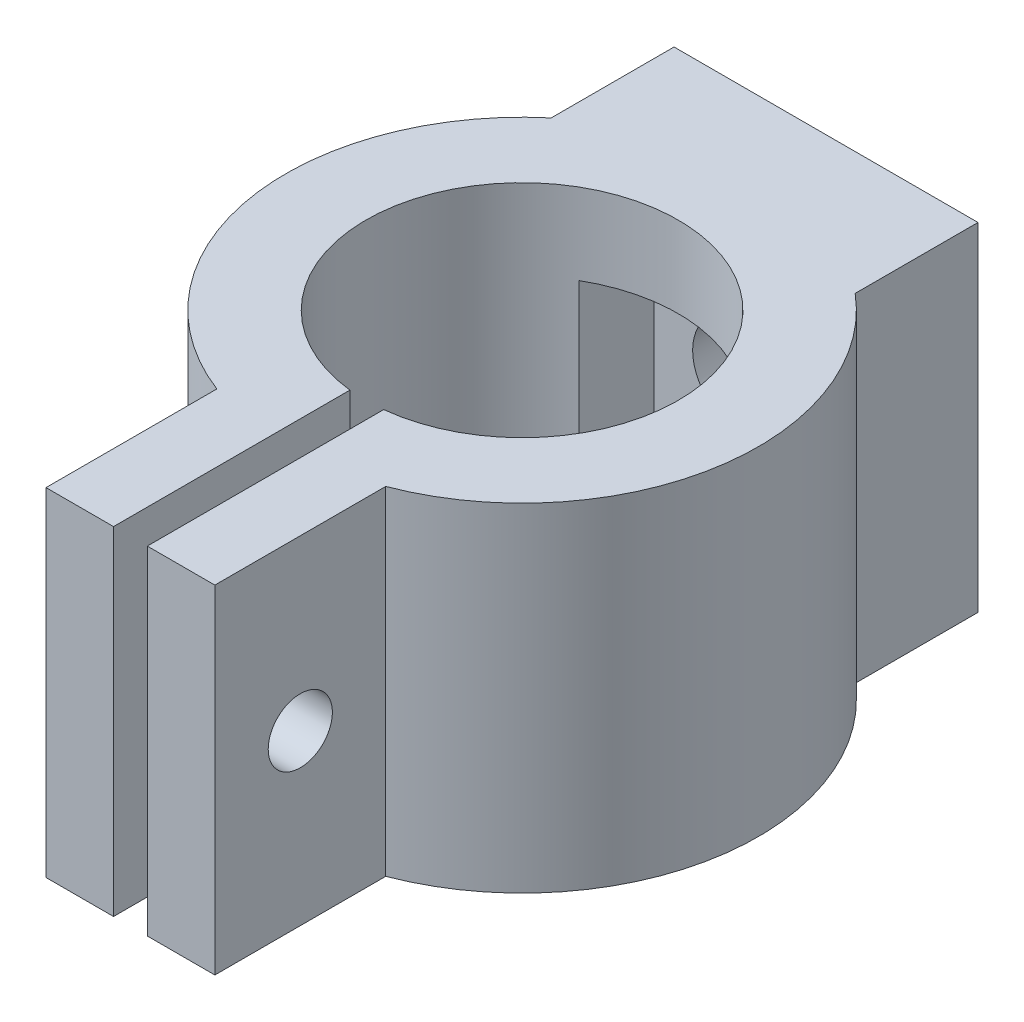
ISO-10303-21;
HEADER;
FILE_DESCRIPTION(('STEP AP214'),'2;1');
FILE_NAME('part.step','',(''),(''),'','','');
FILE_SCHEMA(('AUTOMOTIVE_DESIGN { 1 0 10303 214 1 1 1 1 }'));
ENDSEC;
DATA;
#1=APPLICATION_CONTEXT('core data for automotive mechanical design processes');
#2=APPLICATION_PROTOCOL_DEFINITION('international standard','automotive_design',2000,#1);
#3=PRODUCT_CONTEXT('',#1,'mechanical');
#4=PRODUCT('Part','Part','',(#3));
#5=PRODUCT_RELATED_PRODUCT_CATEGORY('part','',(#4));
#6=PRODUCT_DEFINITION_FORMATION('','',#4);
#7=PRODUCT_DEFINITION_CONTEXT('part definition',#1,'design');
#8=PRODUCT_DEFINITION('design','',#6,#7);
#9=PRODUCT_DEFINITION_SHAPE('','',#8);
#10=(LENGTH_UNIT() NAMED_UNIT(*) SI_UNIT(.MILLI.,.METRE.));
#11=(NAMED_UNIT(*) PLANE_ANGLE_UNIT() SI_UNIT($,.RADIAN.));
#12=(NAMED_UNIT(*) SI_UNIT($,.STERADIAN.) SOLID_ANGLE_UNIT());
#13=UNCERTAINTY_MEASURE_WITH_UNIT(LENGTH_MEASURE(1.E-05),#10,'distance_accuracy_value','');
#14=(GEOMETRIC_REPRESENTATION_CONTEXT(3) GLOBAL_UNCERTAINTY_ASSIGNED_CONTEXT((#13)) GLOBAL_UNIT_ASSIGNED_CONTEXT((#10,
#11,#12)) REPRESENTATION_CONTEXT('',''));
#15=CARTESIAN_POINT('',(0.,0.,0.));
#16=DIRECTION('',(0.,0.,1.));
#17=DIRECTION('',(1.,0.,0.));
#18=AXIS2_PLACEMENT_3D('',#15,#16,#17);
#19=CARTESIAN_POINT('',(0.,10.,9.));
#20=DIRECTION('',(0.,-1.,0.));
#21=DIRECTION('',(0.,0.,-1.));
#22=AXIS2_PLACEMENT_3D('',#19,#20,#21);
#23=CYLINDRICAL_SURFACE('',#22,4.625);
#24=CARTESIAN_POINT('',(0.,0.,9.));
#25=DIRECTION('',(0.,1.,0.));
#26=DIRECTION('',(0.,0.,1.));
#27=AXIS2_PLACEMENT_3D('',#24,#25,#26);
#28=CIRCLE('',#27,4.625);
#29=CARTESIAN_POINT('',(0.5,0.,13.5978935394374));
#30=VERTEX_POINT('',#29);
#31=CARTESIAN_POINT('',(-0.500000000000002,0.,13.5978935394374));
#32=VERTEX_POINT('',#31);
#33=EDGE_CURVE('E192',#30,#32,#28,.T.);
#34=ORIENTED_EDGE('',*,*,#33,.F.);
#35=DIRECTION('',(0.,-1.,0.));
#36=VECTOR('',#35,1.);
#37=CARTESIAN_POINT('',(0.5,10.,13.5978935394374));
#38=LINE('',#37,#36);
#39=CARTESIAN_POINT('',(0.5,10.,13.5978935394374));
#40=VERTEX_POINT('',#39);
#41=EDGE_CURVE('E56',#40,#30,#38,.T.);
#42=ORIENTED_EDGE('',*,*,#41,.F.);
#43=CARTESIAN_POINT('',(0.,10.,9.));
#44=DIRECTION('',(0.,1.,0.));
#45=DIRECTION('',(0.,0.,1.));
#46=AXIS2_PLACEMENT_3D('',#43,#44,#45);
#47=CIRCLE('',#46,4.625);
#48=CARTESIAN_POINT('',(-0.500000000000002,10.,13.5978935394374));
#49=VERTEX_POINT('',#48);
#50=EDGE_CURVE('E160',#40,#49,#47,.T.);
#51=ORIENTED_EDGE('',*,*,#50,.T.);
#52=DIRECTION('',(0.,-1.,0.));
#53=VECTOR('',#52,1.);
#54=CARTESIAN_POINT('',(-0.500000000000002,10.,13.5978935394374));
#55=LINE('',#54,#53);
#56=EDGE_CURVE('E157',#49,#32,#55,.T.);
#57=ORIENTED_EDGE('',*,*,#56,.T.);
#58=EDGE_LOOP('',(#34,#42,#51,#57));
#59=FACE_BOUND('',#58,.T.);
#60=CARTESIAN_POINT('',(0.,7.6,9.));
#61=DIRECTION('',(0.,-1.,0.));
#62=DIRECTION('',(0.,0.,-1.));
#63=AXIS2_PLACEMENT_3D('',#60,#61,#62);
#64=CIRCLE('',#63,4.625);
#65=CARTESIAN_POINT('',(-2.32177195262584,7.6,5.));
#66=VERTEX_POINT('',#65);
#67=CARTESIAN_POINT('',(2.32177195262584,7.6,5.));
#68=VERTEX_POINT('',#67);
#69=EDGE_CURVE('E40',#66,#68,#64,.T.);
#70=ORIENTED_EDGE('',*,*,#69,.T.);
#71=DIRECTION('',(0.,-1.,0.));
#72=VECTOR('',#71,1.);
#73=CARTESIAN_POINT('',(2.32177195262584,10.,5.));
#74=LINE('',#73,#72);
#75=CARTESIAN_POINT('',(2.32177195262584,2.4,5.));
#76=VERTEX_POINT('',#75);
#77=EDGE_CURVE('E11',#68,#76,#74,.T.);
#78=ORIENTED_EDGE('',*,*,#77,.T.);
#79=CARTESIAN_POINT('',(0.,2.4,9.));
#80=DIRECTION('',(0.,1.,0.));
#81=DIRECTION('',(0.,0.,1.));
#82=AXIS2_PLACEMENT_3D('',#79,#80,#81);
#83=CIRCLE('',#82,4.625);
#84=CARTESIAN_POINT('',(-2.32177195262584,2.4,5.));
#85=VERTEX_POINT('',#84);
#86=EDGE_CURVE('E229',#76,#85,#83,.T.);
#87=ORIENTED_EDGE('',*,*,#86,.T.);
#88=DIRECTION('',(0.,-1.,0.));
#89=VECTOR('',#88,1.);
#90=CARTESIAN_POINT('',(-2.32177195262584,10.,5.));
#91=LINE('',#90,#89);
#92=EDGE_CURVE('E216',#85,#66,#91,.F.);
#93=ORIENTED_EDGE('',*,*,#92,.T.);
#94=EDGE_LOOP('',(#70,#78,#87,#93));
#95=FACE_BOUND('',#94,.T.);
#96=ADVANCED_FACE('F32',(#59,#95),#23,.F.);
#97=CARTESIAN_POINT('',(0.5,10.,13.5978935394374));
#98=DIRECTION('',(1.,0.,0.));
#99=DIRECTION('',(0.,0.,-1.));
#100=AXIS2_PLACEMENT_3D('',#97,#98,#99);
#101=PLANE('',#100);
#102=CARTESIAN_POINT('',(0.5,5.,18.0681209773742));
#103=DIRECTION('',(1.,0.,0.));
#104=DIRECTION('',(0.,0.,-1.));
#105=AXIS2_PLACEMENT_3D('',#102,#103,#104);
#106=CIRCLE('',#105,0.950000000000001);
#107=CARTESIAN_POINT('',(0.5,5.,17.1181209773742));
#108=VERTEX_POINT('',#107);
#109=EDGE_CURVE('E220',#108,#108,#106,.T.);
#110=ORIENTED_EDGE('',*,*,#109,.T.);
#111=EDGE_LOOP('',(#110));
#112=FACE_BOUND('',#111,.T.);
#113=DIRECTION('',(0.,0.,1.));
#114=VECTOR('',#113,1.);
#115=CARTESIAN_POINT('',(0.5,0.,13.5978935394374));
#116=LINE('',#115,#114);
#117=CARTESIAN_POINT('',(0.500000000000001,0.,20.5978935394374));
#118=VERTEX_POINT('',#117);
#119=EDGE_CURVE('E165',#30,#118,#116,.T.);
#120=ORIENTED_EDGE('',*,*,#119,.T.);
#121=DIRECTION('',(0.,-1.,0.));
#122=VECTOR('',#121,1.);
#123=CARTESIAN_POINT('',(0.500000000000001,10.,20.5978935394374));
#124=LINE('',#123,#122);
#125=CARTESIAN_POINT('',(0.500000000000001,10.,20.5978935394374));
#126=VERTEX_POINT('',#125);
#127=EDGE_CURVE('E214',#126,#118,#124,.T.);
#128=ORIENTED_EDGE('',*,*,#127,.F.);
#129=DIRECTION('',(0.,0.,1.));
#130=VECTOR('',#129,1.);
#131=CARTESIAN_POINT('',(0.5,10.,13.5978935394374));
#132=LINE('',#131,#130);
#133=EDGE_CURVE('E107',#40,#126,#132,.T.);
#134=ORIENTED_EDGE('',*,*,#133,.F.);
#135=ORIENTED_EDGE('',*,*,#41,.T.);
#136=EDGE_LOOP('',(#120,#128,#134,#135));
#137=FACE_BOUND('',#136,.T.);
#138=ADVANCED_FACE('F34',(#112,#137),#101,.F.);
#139=CARTESIAN_POINT('',(2.5,10.,20.5978935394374));
#140=DIRECTION('',(0.,0.,1.));
#141=DIRECTION('',(1.,0.,0.));
#142=AXIS2_PLACEMENT_3D('',#139,#140,#141);
#143=PLANE('',#142);
#144=DIRECTION('',(-1.,0.,0.));
#145=VECTOR('',#144,1.);
#146=CARTESIAN_POINT('',(2.5,0.,20.5978935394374));
#147=LINE('',#146,#145);
#148=CARTESIAN_POINT('',(2.5,0.,20.5978935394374));
#149=VERTEX_POINT('',#148);
#150=EDGE_CURVE('E167',#149,#118,#147,.T.);
#151=ORIENTED_EDGE('',*,*,#150,.F.);
#152=DIRECTION('',(0.,-1.,0.));
#153=VECTOR('',#152,1.);
#154=CARTESIAN_POINT('',(2.5,10.,20.5978935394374));
#155=LINE('',#154,#153);
#156=CARTESIAN_POINT('',(2.5,10.,20.5978935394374));
#157=VERTEX_POINT('',#156);
#158=EDGE_CURVE('E212',#157,#149,#155,.T.);
#159=ORIENTED_EDGE('',*,*,#158,.F.);
#160=DIRECTION('',(-1.,0.,0.));
#161=VECTOR('',#160,1.);
#162=CARTESIAN_POINT('',(2.5,10.,20.5978935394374));
#163=LINE('',#162,#161);
#164=EDGE_CURVE('E282',#157,#126,#163,.T.);
#165=ORIENTED_EDGE('',*,*,#164,.T.);
#166=ORIENTED_EDGE('',*,*,#127,.T.);
#167=EDGE_LOOP('',(#151,#159,#165,#166));
#168=FACE_BOUND('',#167,.T.);
#169=ADVANCED_FACE('F317',(#168),#143,.T.);
#170=CARTESIAN_POINT('',(2.5,10.,15.538348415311));
#171=DIRECTION('',(1.,0.,0.));
#172=DIRECTION('',(0.,0.,-1.));
#173=AXIS2_PLACEMENT_3D('',#170,#171,#172);
#174=PLANE('',#173);
#175=CARTESIAN_POINT('',(2.5,5.,18.0681209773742));
#176=DIRECTION('',(-1.,0.,0.));
#177=DIRECTION('',(0.,0.,1.));
#178=AXIS2_PLACEMENT_3D('',#175,#176,#177);
#179=CIRCLE('',#178,0.950000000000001);
#180=CARTESIAN_POINT('',(2.5,5.,19.0181209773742));
#181=VERTEX_POINT('',#180);
#182=EDGE_CURVE('E221',#181,#181,#179,.T.);
#183=ORIENTED_EDGE('',*,*,#182,.T.);
#184=EDGE_LOOP('',(#183));
#185=FACE_BOUND('',#184,.T.);
#186=DIRECTION('',(0.,0.,1.));
#187=VECTOR('',#186,1.);
#188=CARTESIAN_POINT('',(2.5,0.,15.538348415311));
#189=LINE('',#188,#187);
#190=CARTESIAN_POINT('',(2.5,0.,15.538348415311));
#191=VERTEX_POINT('',#190);
#192=EDGE_CURVE('E171',#191,#149,#189,.T.);
#193=ORIENTED_EDGE('',*,*,#192,.F.);
#194=DIRECTION('',(0.,-1.,0.));
#195=VECTOR('',#194,1.);
#196=CARTESIAN_POINT('',(2.5,10.,15.538348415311));
#197=LINE('',#196,#195);
#198=CARTESIAN_POINT('',(2.5,10.,15.538348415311));
#199=VERTEX_POINT('',#198);
#200=EDGE_CURVE('E210',#199,#191,#197,.T.);
#201=ORIENTED_EDGE('',*,*,#200,.F.);
#202=DIRECTION('',(0.,0.,1.));
#203=VECTOR('',#202,1.);
#204=CARTESIAN_POINT('',(2.5,10.,15.538348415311));
#205=LINE('',#204,#203);
#206=EDGE_CURVE('E285',#199,#157,#205,.T.);
#207=ORIENTED_EDGE('',*,*,#206,.T.);
#208=ORIENTED_EDGE('',*,*,#158,.T.);
#209=EDGE_LOOP('',(#193,#201,#207,#208));
#210=FACE_BOUND('',#209,.T.);
#211=ADVANCED_FACE('F347',(#185,#210),#174,.T.);
#212=CARTESIAN_POINT('',(0.,10.,9.));
#213=DIRECTION('',(0.,-1.,0.));
#214=DIRECTION('',(0.,0.,-1.));
#215=AXIS2_PLACEMENT_3D('',#212,#213,#214);
#216=CYLINDRICAL_SURFACE('',#215,7.);
#217=CARTESIAN_POINT('',(0.,0.,9.));
#218=DIRECTION('',(0.,1.,0.));
#219=DIRECTION('',(0.,0.,1.));
#220=AXIS2_PLACEMENT_3D('',#217,#218,#219);
#221=CIRCLE('',#220,7.);
#222=CARTESIAN_POINT('',(4.5,0.,3.63809735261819));
#223=VERTEX_POINT('',#222);
#224=EDGE_CURVE('E174',#191,#223,#221,.T.);
#225=ORIENTED_EDGE('',*,*,#224,.T.);
#226=DIRECTION('',(0.,-1.,0.));
#227=VECTOR('',#226,1.);
#228=CARTESIAN_POINT('',(4.5,10.,3.63809735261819));
#229=LINE('',#228,#227);
#230=CARTESIAN_POINT('',(4.5,10.,3.63809735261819));
#231=VERTEX_POINT('',#230);
#232=EDGE_CURVE('E208',#231,#223,#229,.T.);
#233=ORIENTED_EDGE('',*,*,#232,.F.);
#234=CARTESIAN_POINT('',(0.,10.,9.));
#235=DIRECTION('',(0.,1.,0.));
#236=DIRECTION('',(0.,0.,1.));
#237=AXIS2_PLACEMENT_3D('',#234,#235,#236);
#238=CIRCLE('',#237,7.);
#239=EDGE_CURVE('E288',#199,#231,#238,.T.);
#240=ORIENTED_EDGE('',*,*,#239,.F.);
#241=ORIENTED_EDGE('',*,*,#200,.T.);
#242=EDGE_LOOP('',(#225,#233,#240,#241));
#243=FACE_BOUND('',#242,.T.);
#244=ADVANCED_FACE('F343',(#243),#216,.T.);
#245=CARTESIAN_POINT('',(4.5,10.,0.));
#246=DIRECTION('',(1.,0.,0.));
#247=DIRECTION('',(0.,0.,-1.));
#248=AXIS2_PLACEMENT_3D('',#245,#246,#247);
#249=PLANE('',#248);
#250=DIRECTION('',(0.,0.,1.));
#251=VECTOR('',#250,1.);
#252=CARTESIAN_POINT('',(4.5,0.,0.));
#253=LINE('',#252,#251);
#254=CARTESIAN_POINT('',(4.5,0.,0.));
#255=VERTEX_POINT('',#254);
#256=EDGE_CURVE('E177',#255,#223,#253,.T.);
#257=ORIENTED_EDGE('',*,*,#256,.F.);
#258=DIRECTION('',(0.,-1.,0.));
#259=VECTOR('',#258,1.);
#260=CARTESIAN_POINT('',(4.5,10.,0.));
#261=LINE('',#260,#259);
#262=CARTESIAN_POINT('',(4.5,10.,0.));
#263=VERTEX_POINT('',#262);
#264=EDGE_CURVE('E206',#263,#255,#261,.T.);
#265=ORIENTED_EDGE('',*,*,#264,.F.);
#266=DIRECTION('',(0.,0.,1.));
#267=VECTOR('',#266,1.);
#268=CARTESIAN_POINT('',(4.5,10.,0.));
#269=LINE('',#268,#267);
#270=EDGE_CURVE('E290',#263,#231,#269,.T.);
#271=ORIENTED_EDGE('',*,*,#270,.T.);
#272=ORIENTED_EDGE('',*,*,#232,.T.);
#273=EDGE_LOOP('',(#257,#265,#271,#272));
#274=FACE_BOUND('',#273,.T.);
#275=ADVANCED_FACE('F339',(#274),#249,.T.);
#276=CARTESIAN_POINT('',(-4.5,10.,0.));
#277=DIRECTION('',(0.,0.,-1.));
#278=DIRECTION('',(-1.,0.,0.));
#279=AXIS2_PLACEMENT_3D('',#276,#277,#278);
#280=PLANE('',#279);
#281=CARTESIAN_POINT('',(0.,5.,0.));
#282=DIRECTION('',(0.,0.,-1.));
#283=DIRECTION('',(-1.,0.,0.));
#284=AXIS2_PLACEMENT_3D('',#281,#282,#283);
#285=CIRCLE('',#284,1.45);
#286=CARTESIAN_POINT('',(-1.45,5.,0.));
#287=VERTEX_POINT('',#286);
#288=EDGE_CURVE('E168',#287,#287,#285,.T.);
#289=ORIENTED_EDGE('',*,*,#288,.F.);
#290=EDGE_LOOP('',(#289));
#291=FACE_BOUND('',#290,.T.);
#292=DIRECTION('',(1.,0.,0.));
#293=VECTOR('',#292,1.);
#294=CARTESIAN_POINT('',(-4.5,0.,0.));
#295=LINE('',#294,#293);
#296=CARTESIAN_POINT('',(-4.5,0.,0.));
#297=VERTEX_POINT('',#296);
#298=EDGE_CURVE('E180',#297,#255,#295,.T.);
#299=ORIENTED_EDGE('',*,*,#298,.F.);
#300=DIRECTION('',(0.,-1.,0.));
#301=VECTOR('',#300,1.);
#302=CARTESIAN_POINT('',(-4.5,10.,0.));
#303=LINE('',#302,#301);
#304=CARTESIAN_POINT('',(-4.5,10.,0.));
#305=VERTEX_POINT('',#304);
#306=EDGE_CURVE('E204',#305,#297,#303,.T.);
#307=ORIENTED_EDGE('',*,*,#306,.F.);
#308=DIRECTION('',(1.,0.,0.));
#309=VECTOR('',#308,1.);
#310=CARTESIAN_POINT('',(-4.5,10.,0.));
#311=LINE('',#310,#309);
#312=EDGE_CURVE('E293',#305,#263,#311,.T.);
#313=ORIENTED_EDGE('',*,*,#312,.T.);
#314=ORIENTED_EDGE('',*,*,#264,.T.);
#315=EDGE_LOOP('',(#299,#307,#313,#314));
#316=FACE_BOUND('',#315,.T.);
#317=ADVANCED_FACE('F335',(#291,#316),#280,.T.);
#318=CARTESIAN_POINT('',(-4.5,10.,0.));
#319=DIRECTION('',(1.,0.,0.));
#320=DIRECTION('',(0.,0.,-1.));
#321=AXIS2_PLACEMENT_3D('',#318,#319,#320);
#322=PLANE('',#321);
#323=DIRECTION('',(0.,0.,1.));
#324=VECTOR('',#323,1.);
#325=CARTESIAN_POINT('',(-4.5,0.,0.));
#326=LINE('',#325,#324);
#327=CARTESIAN_POINT('',(-4.5,0.,3.63809735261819));
#328=VERTEX_POINT('',#327);
#329=EDGE_CURVE('E183',#297,#328,#326,.T.);
#330=ORIENTED_EDGE('',*,*,#329,.T.);
#331=DIRECTION('',(0.,-1.,0.));
#332=VECTOR('',#331,1.);
#333=CARTESIAN_POINT('',(-4.5,10.,3.63809735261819));
#334=LINE('',#333,#332);
#335=CARTESIAN_POINT('',(-4.5,10.,3.63809735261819));
#336=VERTEX_POINT('',#335);
#337=EDGE_CURVE('E201',#336,#328,#334,.T.);
#338=ORIENTED_EDGE('',*,*,#337,.F.);
#339=DIRECTION('',(0.,0.,1.));
#340=VECTOR('',#339,1.);
#341=CARTESIAN_POINT('',(-4.5,10.,0.));
#342=LINE('',#341,#340);
#343=EDGE_CURVE('E296',#305,#336,#342,.T.);
#344=ORIENTED_EDGE('',*,*,#343,.F.);
#345=ORIENTED_EDGE('',*,*,#306,.T.);
#346=EDGE_LOOP('',(#330,#338,#344,#345));
#347=FACE_BOUND('',#346,.T.);
#348=ADVANCED_FACE('F332',(#347),#322,.F.);
#349=CARTESIAN_POINT('',(0.,10.,9.));
#350=DIRECTION('',(0.,-1.,0.));
#351=DIRECTION('',(0.,0.,-1.));
#352=AXIS2_PLACEMENT_3D('',#349,#350,#351);
#353=CYLINDRICAL_SURFACE('',#352,7.);
#354=CARTESIAN_POINT('',(0.,0.,9.));
#355=DIRECTION('',(0.,1.,0.));
#356=DIRECTION('',(0.,0.,1.));
#357=AXIS2_PLACEMENT_3D('',#354,#355,#356);
#358=CIRCLE('',#357,7.);
#359=CARTESIAN_POINT('',(-2.5,0.,15.538348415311));
#360=VERTEX_POINT('',#359);
#361=EDGE_CURVE('E185',#328,#360,#358,.T.);
#362=ORIENTED_EDGE('',*,*,#361,.T.);
#363=DIRECTION('',(0.,-1.,0.));
#364=VECTOR('',#363,1.);
#365=CARTESIAN_POINT('',(-2.5,10.,15.538348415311));
#366=LINE('',#365,#364);
#367=CARTESIAN_POINT('',(-2.5,10.,15.538348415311));
#368=VERTEX_POINT('',#367);
#369=EDGE_CURVE('E198',#368,#360,#366,.T.);
#370=ORIENTED_EDGE('',*,*,#369,.F.);
#371=CARTESIAN_POINT('',(0.,10.,9.));
#372=DIRECTION('',(0.,1.,0.));
#373=DIRECTION('',(0.,0.,1.));
#374=AXIS2_PLACEMENT_3D('',#371,#372,#373);
#375=CIRCLE('',#374,7.);
#376=EDGE_CURVE('E298',#336,#368,#375,.T.);
#377=ORIENTED_EDGE('',*,*,#376,.F.);
#378=ORIENTED_EDGE('',*,*,#337,.T.);
#379=EDGE_LOOP('',(#362,#370,#377,#378));
#380=FACE_BOUND('',#379,.T.);
#381=ADVANCED_FACE('F305',(#380),#353,.T.);
#382=CARTESIAN_POINT('',(-2.5,10.,15.538348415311));
#383=DIRECTION('',(1.,0.,0.));
#384=DIRECTION('',(0.,0.,-1.));
#385=AXIS2_PLACEMENT_3D('',#382,#383,#384);
#386=PLANE('',#385);
#387=CARTESIAN_POINT('',(-2.5,5.,18.0681209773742));
#388=DIRECTION('',(-1.,0.,0.));
#389=DIRECTION('',(0.,0.,1.));
#390=AXIS2_PLACEMENT_3D('',#387,#388,#389);
#391=CIRCLE('',#390,0.950000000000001);
#392=CARTESIAN_POINT('',(-2.5,5.,19.0181209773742));
#393=VERTEX_POINT('',#392);
#394=EDGE_CURVE('E225',#393,#393,#391,.T.);
#395=ORIENTED_EDGE('',*,*,#394,.F.);
#396=EDGE_LOOP('',(#395));
#397=FACE_BOUND('',#396,.T.);
#398=DIRECTION('',(0.,0.,1.));
#399=VECTOR('',#398,1.);
#400=CARTESIAN_POINT('',(-2.5,0.,15.538348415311));
#401=LINE('',#400,#399);
#402=CARTESIAN_POINT('',(-2.5,0.,20.5978935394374));
#403=VERTEX_POINT('',#402);
#404=EDGE_CURVE('E187',#360,#403,#401,.T.);
#405=ORIENTED_EDGE('',*,*,#404,.T.);
#406=DIRECTION('',(0.,-1.,0.));
#407=VECTOR('',#406,1.);
#408=CARTESIAN_POINT('',(-2.5,10.,20.5978935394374));
#409=LINE('',#408,#407);
#410=CARTESIAN_POINT('',(-2.5,10.,20.5978935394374));
#411=VERTEX_POINT('',#410);
#412=EDGE_CURVE('E156',#411,#403,#409,.T.);
#413=ORIENTED_EDGE('',*,*,#412,.F.);
#414=DIRECTION('',(0.,0.,1.));
#415=VECTOR('',#414,1.);
#416=CARTESIAN_POINT('',(-2.5,10.,15.538348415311));
#417=LINE('',#416,#415);
#418=EDGE_CURVE('E143',#368,#411,#417,.T.);
#419=ORIENTED_EDGE('',*,*,#418,.F.);
#420=ORIENTED_EDGE('',*,*,#369,.T.);
#421=EDGE_LOOP('',(#405,#413,#419,#420));
#422=FACE_BOUND('',#421,.T.);
#423=ADVANCED_FACE('F309',(#397,#422),#386,.F.);
#424=CARTESIAN_POINT('',(-2.5,10.,20.5978935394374));
#425=DIRECTION('',(0.,0.,-1.));
#426=DIRECTION('',(-1.,0.,0.));
#427=AXIS2_PLACEMENT_3D('',#424,#425,#426);
#428=PLANE('',#427);
#429=DIRECTION('',(1.,0.,0.));
#430=VECTOR('',#429,1.);
#431=CARTESIAN_POINT('',(-2.5,0.,20.5978935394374));
#432=LINE('',#431,#430);
#433=CARTESIAN_POINT('',(-0.500000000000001,0.,20.5978935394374));
#434=VERTEX_POINT('',#433);
#435=EDGE_CURVE('E152',#403,#434,#432,.T.);
#436=ORIENTED_EDGE('',*,*,#435,.T.);
#437=DIRECTION('',(0.,-1.,0.));
#438=VECTOR('',#437,1.);
#439=CARTESIAN_POINT('',(-0.500000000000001,10.,20.5978935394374));
#440=LINE('',#439,#438);
#441=CARTESIAN_POINT('',(-0.500000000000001,10.,20.5978935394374));
#442=VERTEX_POINT('',#441);
#443=EDGE_CURVE('E149',#442,#434,#440,.T.);
#444=ORIENTED_EDGE('',*,*,#443,.F.);
#445=DIRECTION('',(1.,0.,0.));
#446=VECTOR('',#445,1.);
#447=CARTESIAN_POINT('',(-2.5,10.,20.5978935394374));
#448=LINE('',#447,#446);
#449=EDGE_CURVE('E137',#411,#442,#448,.T.);
#450=ORIENTED_EDGE('',*,*,#449,.F.);
#451=ORIENTED_EDGE('',*,*,#412,.T.);
#452=EDGE_LOOP('',(#436,#444,#450,#451));
#453=FACE_BOUND('',#452,.T.);
#454=ADVANCED_FACE('F150',(#453),#428,.F.);
#455=CARTESIAN_POINT('',(-0.5,10.,13.5978935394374));
#456=DIRECTION('',(1.,0.,0.));
#457=DIRECTION('',(0.,0.,-1.));
#458=AXIS2_PLACEMENT_3D('',#455,#456,#457);
#459=PLANE('',#458);
#460=CARTESIAN_POINT('',(-0.5,5.,18.0681209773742));
#461=DIRECTION('',(1.,0.,0.));
#462=DIRECTION('',(0.,0.,-1.));
#463=AXIS2_PLACEMENT_3D('',#460,#461,#462);
#464=CIRCLE('',#463,0.950000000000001);
#465=CARTESIAN_POINT('',(-0.5,5.,17.1181209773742));
#466=VERTEX_POINT('',#465);
#467=EDGE_CURVE('E217',#466,#466,#464,.T.);
#468=ORIENTED_EDGE('',*,*,#467,.F.);
#469=EDGE_LOOP('',(#468));
#470=FACE_BOUND('',#469,.T.);
#471=DIRECTION('',(0.,0.,1.));
#472=VECTOR('',#471,1.);
#473=CARTESIAN_POINT('',(-0.5,0.,13.5978935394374));
#474=LINE('',#473,#472);
#475=EDGE_CURVE('E190',#32,#434,#474,.T.);
#476=ORIENTED_EDGE('',*,*,#475,.F.);
#477=ORIENTED_EDGE('',*,*,#56,.F.);
#478=DIRECTION('',(0.,0.,1.));
#479=VECTOR('',#478,1.);
#480=CARTESIAN_POINT('',(-0.5,10.,13.5978935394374));
#481=LINE('',#480,#479);
#482=EDGE_CURVE('E141',#49,#442,#481,.T.);
#483=ORIENTED_EDGE('',*,*,#482,.T.);
#484=ORIENTED_EDGE('',*,*,#443,.T.);
#485=EDGE_LOOP('',(#476,#477,#483,#484));
#486=FACE_BOUND('',#485,.T.);
#487=ADVANCED_FACE('F159',(#470,#486),#459,.T.);
#488=CARTESIAN_POINT('',(0.,10.,9.));
#489=DIRECTION('',(0.,1.,0.));
#490=DIRECTION('',(0.,0.,1.));
#491=AXIS2_PLACEMENT_3D('',#488,#489,#490);
#492=PLANE('',#491);
#493=ORIENTED_EDGE('',*,*,#133,.T.);
#494=ORIENTED_EDGE('',*,*,#164,.F.);
#495=ORIENTED_EDGE('',*,*,#206,.F.);
#496=ORIENTED_EDGE('',*,*,#239,.T.);
#497=ORIENTED_EDGE('',*,*,#270,.F.);
#498=ORIENTED_EDGE('',*,*,#312,.F.);
#499=ORIENTED_EDGE('',*,*,#343,.T.);
#500=ORIENTED_EDGE('',*,*,#376,.T.);
#501=ORIENTED_EDGE('',*,*,#418,.T.);
#502=ORIENTED_EDGE('',*,*,#449,.T.);
#503=ORIENTED_EDGE('',*,*,#482,.F.);
#504=ORIENTED_EDGE('',*,*,#50,.F.);
#505=EDGE_LOOP('',(#493,#494,#495,#496,#497,#498,#499,#500,#501,#502,#503,#504));
#506=FACE_BOUND('',#505,.T.);
#507=ADVANCED_FACE('F139',(#506),#492,.T.);
#508=CARTESIAN_POINT('',(0.,0.,9.));
#509=DIRECTION('',(0.,1.,0.));
#510=DIRECTION('',(0.,0.,1.));
#511=AXIS2_PLACEMENT_3D('',#508,#509,#510);
#512=PLANE('',#511);
#513=ORIENTED_EDGE('',*,*,#119,.F.);
#514=ORIENTED_EDGE('',*,*,#33,.T.);
#515=ORIENTED_EDGE('',*,*,#475,.T.);
#516=ORIENTED_EDGE('',*,*,#435,.F.);
#517=ORIENTED_EDGE('',*,*,#404,.F.);
#518=ORIENTED_EDGE('',*,*,#361,.F.);
#519=ORIENTED_EDGE('',*,*,#329,.F.);
#520=ORIENTED_EDGE('',*,*,#298,.T.);
#521=ORIENTED_EDGE('',*,*,#256,.T.);
#522=ORIENTED_EDGE('',*,*,#224,.F.);
#523=ORIENTED_EDGE('',*,*,#192,.T.);
#524=ORIENTED_EDGE('',*,*,#150,.T.);
#525=EDGE_LOOP('',(#513,#514,#515,#516,#517,#518,#519,#520,#521,#522,#523,#524));
#526=FACE_BOUND('',#525,.T.);
#527=ADVANCED_FACE('F311',(#526),#512,.F.);
#528=CARTESIAN_POINT('',(0.,5.,5.));
#529=DIRECTION('',(0.,0.,-1.));
#530=DIRECTION('',(-1.,0.,0.));
#531=AXIS2_PLACEMENT_3D('',#528,#529,#530);
#532=CYLINDRICAL_SURFACE('',#531,1.45);
#533=CARTESIAN_POINT('',(0.,5.,2.5));
#534=DIRECTION('',(0.,0.,-1.));
#535=DIRECTION('',(-1.,0.,0.));
#536=AXIS2_PLACEMENT_3D('',#533,#534,#535);
#537=CIRCLE('',#536,1.45);
#538=CARTESIAN_POINT('',(-1.45,5.,2.5));
#539=VERTEX_POINT('',#538);
#540=EDGE_CURVE('E222',#539,#539,#537,.F.);
#541=ORIENTED_EDGE('',*,*,#540,.T.);
#542=EDGE_LOOP('',(#541));
#543=FACE_BOUND('',#542,.T.);
#544=ORIENTED_EDGE('',*,*,#288,.T.);
#545=EDGE_LOOP('',(#544));
#546=FACE_BOUND('',#545,.T.);
#547=ADVANCED_FACE('F417',(#543,#546),#532,.F.);
#548=CARTESIAN_POINT('',(2.5,5.,18.0681209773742));
#549=DIRECTION('',(-1.,0.,0.));
#550=DIRECTION('',(0.,0.,1.));
#551=AXIS2_PLACEMENT_3D('',#548,#549,#550);
#552=CYLINDRICAL_SURFACE('',#551,0.950000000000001);
#553=ORIENTED_EDGE('',*,*,#467,.T.);
#554=EDGE_LOOP('',(#553));
#555=FACE_BOUND('',#554,.T.);
#556=ORIENTED_EDGE('',*,*,#394,.T.);
#557=EDGE_LOOP('',(#556));
#558=FACE_BOUND('',#557,.T.);
#559=ADVANCED_FACE('F423',(#555,#558),#552,.F.);
#560=ORIENTED_EDGE('',*,*,#182,.F.);
#561=EDGE_LOOP('',(#560));
#562=FACE_BOUND('',#561,.T.);
#563=ORIENTED_EDGE('',*,*,#109,.F.);
#564=EDGE_LOOP('',(#563));
#565=FACE_BOUND('',#564,.T.);
#566=ADVANCED_FACE('F431',(#562,#565),#552,.F.);
#567=CARTESIAN_POINT('',(0.,0.,5.));
#568=DIRECTION('',(0.,0.,-1.));
#569=DIRECTION('',(-1.,0.,0.));
#570=AXIS2_PLACEMENT_3D('',#567,#568,#569);
#571=PLANE('',#570);
#572=DIRECTION('',(1.,0.,0.));
#573=VECTOR('',#572,1.);
#574=CARTESIAN_POINT('',(2.6,7.6,5.));
#575=LINE('',#574,#573);
#576=CARTESIAN_POINT('',(2.6,7.6,5.));
#577=VERTEX_POINT('',#576);
#578=EDGE_CURVE('E244',#68,#577,#575,.T.);
#579=ORIENTED_EDGE('',*,*,#578,.T.);
#580=DIRECTION('',(0.,-1.,0.));
#581=VECTOR('',#580,1.);
#582=CARTESIAN_POINT('',(2.6,7.6,5.));
#583=LINE('',#582,#581);
#584=CARTESIAN_POINT('',(2.6,2.4,5.));
#585=VERTEX_POINT('',#584);
#586=EDGE_CURVE('E254',#577,#585,#583,.T.);
#587=ORIENTED_EDGE('',*,*,#586,.T.);
#588=DIRECTION('',(-1.,0.,0.));
#589=VECTOR('',#588,1.);
#590=CARTESIAN_POINT('',(2.6,2.4,5.));
#591=LINE('',#590,#589);
#592=EDGE_CURVE('E260',#585,#76,#591,.T.);
#593=ORIENTED_EDGE('',*,*,#592,.T.);
#594=ORIENTED_EDGE('',*,*,#77,.F.);
#595=EDGE_LOOP('',(#579,#587,#593,#594));
#596=FACE_BOUND('',#595,.T.);
#597=ADVANCED_FACE('F439',(#596),#571,.T.);
#598=CARTESIAN_POINT('',(0.,0.,2.5));
#599=DIRECTION('',(0.,0.,-1.));
#600=DIRECTION('',(-1.,0.,0.));
#601=AXIS2_PLACEMENT_3D('',#598,#599,#600);
#602=PLANE('',#601);
#603=DIRECTION('',(0.,1.,0.));
#604=VECTOR('',#603,1.);
#605=CARTESIAN_POINT('',(-2.6,7.6,2.5));
#606=LINE('',#605,#604);
#607=CARTESIAN_POINT('',(-2.6,2.4,2.5));
#608=VERTEX_POINT('',#607);
#609=CARTESIAN_POINT('',(-2.6,7.6,2.5));
#610=VERTEX_POINT('',#609);
#611=EDGE_CURVE('E263',#608,#610,#606,.T.);
#612=ORIENTED_EDGE('',*,*,#611,.F.);
#613=DIRECTION('',(-1.,0.,0.));
#614=VECTOR('',#613,1.);
#615=CARTESIAN_POINT('',(2.6,2.4,2.5));
#616=LINE('',#615,#614);
#617=CARTESIAN_POINT('',(2.6,2.4,2.5));
#618=VERTEX_POINT('',#617);
#619=EDGE_CURVE('E268',#618,#608,#616,.T.);
#620=ORIENTED_EDGE('',*,*,#619,.F.);
#621=DIRECTION('',(0.,-1.,0.));
#622=VECTOR('',#621,1.);
#623=CARTESIAN_POINT('',(2.6,7.6,2.5));
#624=LINE('',#623,#622);
#625=CARTESIAN_POINT('',(2.6,7.6,2.5));
#626=VERTEX_POINT('',#625);
#627=EDGE_CURVE('E573',#626,#618,#624,.T.);
#628=ORIENTED_EDGE('',*,*,#627,.F.);
#629=DIRECTION('',(1.,0.,0.));
#630=VECTOR('',#629,1.);
#631=CARTESIAN_POINT('',(2.6,7.6,2.5));
#632=LINE('',#631,#630);
#633=EDGE_CURVE('E562',#610,#626,#632,.T.);
#634=ORIENTED_EDGE('',*,*,#633,.F.);
#635=EDGE_LOOP('',(#612,#620,#628,#634));
#636=FACE_BOUND('',#635,.T.);
#637=ORIENTED_EDGE('',*,*,#540,.F.);
#638=EDGE_LOOP('',(#637));
#639=FACE_BOUND('',#638,.T.);
#640=ADVANCED_FACE('F445',(#636,#639),#602,.F.);
#641=CARTESIAN_POINT('',(-2.6,7.6,2.5));
#642=DIRECTION('',(1.,0.,0.));
#643=DIRECTION('',(0.,1.,0.));
#644=AXIS2_PLACEMENT_3D('',#641,#642,#643);
#645=PLANE('',#644);
#646=DIRECTION('',(0.,1.,0.));
#647=VECTOR('',#646,1.);
#648=CARTESIAN_POINT('',(-2.6,7.6,5.));
#649=LINE('',#648,#647);
#650=CARTESIAN_POINT('',(-2.6,2.4,5.));
#651=VERTEX_POINT('',#650);
#652=CARTESIAN_POINT('',(-2.6,7.6,5.));
#653=VERTEX_POINT('',#652);
#654=EDGE_CURVE('E252',#651,#653,#649,.T.);
#655=ORIENTED_EDGE('',*,*,#654,.F.);
#656=DIRECTION('',(0.,0.,1.));
#657=VECTOR('',#656,1.);
#658=CARTESIAN_POINT('',(-2.6,2.4,2.5));
#659=LINE('',#658,#657);
#660=EDGE_CURVE('E264',#608,#651,#659,.T.);
#661=ORIENTED_EDGE('',*,*,#660,.F.);
#662=ORIENTED_EDGE('',*,*,#611,.T.);
#663=DIRECTION('',(0.,0.,1.));
#664=VECTOR('',#663,1.);
#665=CARTESIAN_POINT('',(-2.6,7.6,2.5));
#666=LINE('',#665,#664);
#667=EDGE_CURVE('E226',#610,#653,#666,.T.);
#668=ORIENTED_EDGE('',*,*,#667,.T.);
#669=EDGE_LOOP('',(#655,#661,#662,#668));
#670=FACE_BOUND('',#669,.T.);
#671=ADVANCED_FACE('F453',(#670),#645,.T.);
#672=CARTESIAN_POINT('',(2.6,7.6,2.5));
#673=DIRECTION('',(0.,-1.,0.));
#674=DIRECTION('',(0.,0.,-1.));
#675=AXIS2_PLACEMENT_3D('',#672,#673,#674);
#676=PLANE('',#675);
#677=EDGE_CURVE('E47',#653,#66,#575,.T.);
#678=ORIENTED_EDGE('',*,*,#677,.F.);
#679=ORIENTED_EDGE('',*,*,#667,.F.);
#680=ORIENTED_EDGE('',*,*,#633,.T.);
#681=DIRECTION('',(0.,0.,1.));
#682=VECTOR('',#681,1.);
#683=CARTESIAN_POINT('',(2.6,7.6,2.5));
#684=LINE('',#683,#682);
#685=EDGE_CURVE('E248',#626,#577,#684,.T.);
#686=ORIENTED_EDGE('',*,*,#685,.T.);
#687=ORIENTED_EDGE('',*,*,#578,.F.);
#688=ORIENTED_EDGE('',*,*,#69,.F.);
#689=EDGE_LOOP('',(#678,#679,#680,#686,#687,#688));
#690=FACE_BOUND('',#689,.T.);
#691=ADVANCED_FACE('F238',(#690),#676,.T.);
#692=CARTESIAN_POINT('',(2.6,7.6,2.5));
#693=DIRECTION('',(-1.,0.,0.));
#694=DIRECTION('',(0.,-1.,0.));
#695=AXIS2_PLACEMENT_3D('',#692,#693,#694);
#696=PLANE('',#695);
#697=ORIENTED_EDGE('',*,*,#586,.F.);
#698=ORIENTED_EDGE('',*,*,#685,.F.);
#699=ORIENTED_EDGE('',*,*,#627,.T.);
#700=DIRECTION('',(0.,0.,1.));
#701=VECTOR('',#700,1.);
#702=CARTESIAN_POINT('',(2.6,2.4,2.5));
#703=LINE('',#702,#701);
#704=EDGE_CURVE('E267',#618,#585,#703,.T.);
#705=ORIENTED_EDGE('',*,*,#704,.T.);
#706=EDGE_LOOP('',(#697,#698,#699,#705));
#707=FACE_BOUND('',#706,.T.);
#708=ADVANCED_FACE('F468',(#707),#696,.T.);
#709=CARTESIAN_POINT('',(2.6,2.4,2.5));
#710=DIRECTION('',(0.,1.,0.));
#711=DIRECTION('',(0.,0.,1.));
#712=AXIS2_PLACEMENT_3D('',#709,#710,#711);
#713=PLANE('',#712);
#714=ORIENTED_EDGE('',*,*,#592,.F.);
#715=ORIENTED_EDGE('',*,*,#704,.F.);
#716=ORIENTED_EDGE('',*,*,#619,.T.);
#717=ORIENTED_EDGE('',*,*,#660,.T.);
#718=EDGE_CURVE('E259',#85,#651,#591,.T.);
#719=ORIENTED_EDGE('',*,*,#718,.F.);
#720=ORIENTED_EDGE('',*,*,#86,.F.);
#721=EDGE_LOOP('',(#714,#715,#716,#717,#719,#720));
#722=FACE_BOUND('',#721,.T.);
#723=ADVANCED_FACE('F475',(#722),#713,.T.);
#724=ORIENTED_EDGE('',*,*,#718,.T.);
#725=ORIENTED_EDGE('',*,*,#654,.T.);
#726=ORIENTED_EDGE('',*,*,#677,.T.);
#727=ORIENTED_EDGE('',*,*,#92,.F.);
#728=EDGE_LOOP('',(#724,#725,#726,#727));
#729=FACE_BOUND('',#728,.T.);
#730=ADVANCED_FACE('F447',(#729),#571,.T.);
#731=CLOSED_SHELL('',(#96,#138,#169,#211,#244,#275,#317,#348,#381,#423,#454,#487,#507,#527,#547,
#559,#566,#597,#640,#671,#691,#708,#723,#730));
#732=MANIFOLD_SOLID_BREP('B2',#731);
#733=ADVANCED_BREP_SHAPE_REPRESENTATION('',(#18,#732),#14);
#734=SHAPE_DEFINITION_REPRESENTATION(#9,#733);
ENDSEC;
END-ISO-10303-21;
